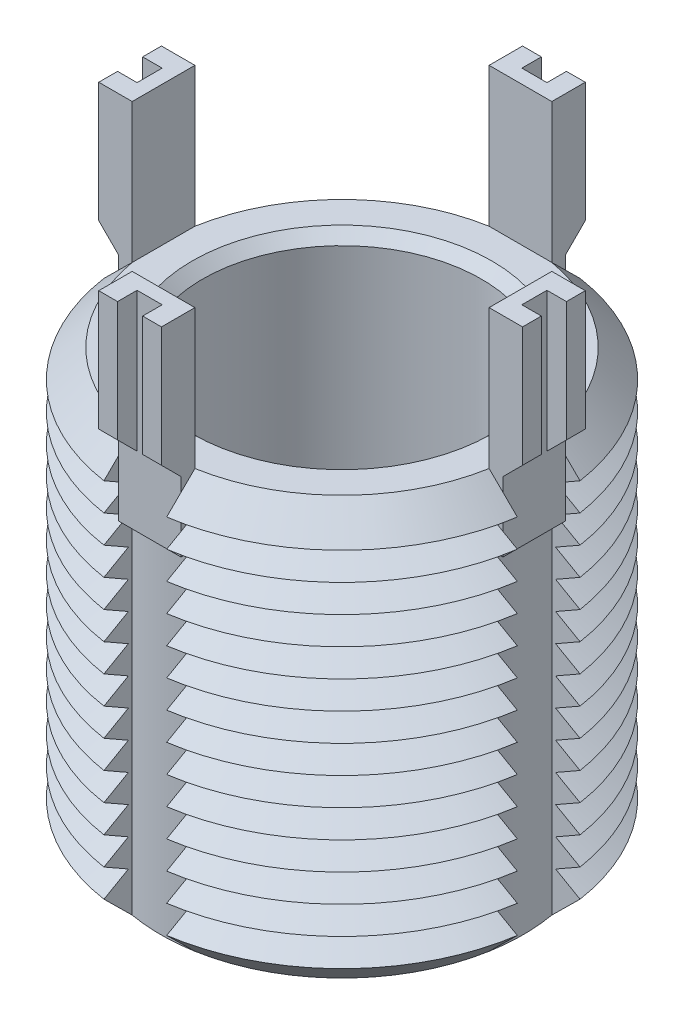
from build123d import *

# Parameters (mm, degrees)
SKETCH1_R               = 15
BOSS_EXTRUDE1_DEPTH     = 30
CHAMFER1_SIZE           = 2
LPATTERN1_COUNT         = 13
LPATTERN1_PITCH         = 2
CUT_EXTRUDE1_REACH      = 38.742
CIRPATTERN1_COUNT       = 4
BOSS_EXTRUDE3_DEPTH     = 2.25
CIRPATTERN2_COUNT       = 4
CUT_EXTRUDE3_DEPTH      = 46.412680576
CUT_EXTRUDE3_DEPTH_BACK = 46.412680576
SKETCH6_W               = 1.4
SKETCH6_H               = 1.8
SKETCH6_W_2             = 1.8
SKETCH6_H_2             = 1.4
SKETCH7_R               = 10
CUT_EXTRUDE4_DEPTH      = 30
CHAMFER2_SIZE           = 0.75


with BuildPart() as part:
    # Sketch1 → Boss-Extrude1 (new body)
    with BuildSketch(Plane(origin=(0, 0, 0), x_dir=(1, 0, 0), z_dir=(0, 1, 0))):
        with Locations(Location((0, 0, 0), (0, 0, 270))):
            Circle(SKETCH1_R)
    extrude(amount=-BOSS_EXTRUDE1_DEPTH)

    # Chamfer1
    chamfer1_edges = [part.edges().sort_by_distance(p)[0] for p in [
        (0, 0, -15),
        (0, -30, -15),
    ]]
    chamfer(chamfer1_edges, length=CHAMFER1_SIZE)

    # Sketch3 → Cut-Revolve1 (revolve, cut)
    with BuildSketch(Plane(origin=(0, 0, 0), x_dir=(0, 0, -1), z_dir=(1, 0, 0))):
        Polygon((-15, -2), (-13.267949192, -3), (-15, -4), align=None)
    cut_revolve1 = revolve(axis=Axis((0, 0.885892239, 0), (0, -1, 0)), mode=Mode.SUBTRACT)

    # LPattern1: Cut-Revolve1 ×13
    with Locations(*[(0, -i * LPATTERN1_PITCH, 0) for i in range(1, LPATTERN1_COUNT)]):
        add(cut_revolve1, mode=Mode.SUBTRACT)

    # Cut-Extrude1: up to this cone (the profile starts inside it)
    cut_extrude1_end = Plane(origin=(0, 0, 0), z_dir=(0, 1, 0)).offset(-42.999999) * Cone(1e-06, 125.242, 125.241999, align=(Align.CENTER, Align.CENTER, Align.MIN), mode=Mode.PRIVATE)
    # Sketch4 → Cut-Extrude1 (cut, up to the surface)
    with BuildSketch(Plane(origin=(0, 0, 0), x_dir=(1, 0, 0), z_dir=(0, 1, 0)), mode=Mode.PRIVATE) as cut_extrude1_sk1:
        with BuildLine():
            Line((-12.803808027, 2.25), (-14.83028995, 2.25))
            ThreePointArc((-14.83028995, 2.25), (-15, 0), (-14.83028995, -2.25))
            Line((-14.83028995, -2.25), (-12.803808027, -2.25))
            ThreePointArc((-12.803808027, -2.25), (-13, 0), (-12.803808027, 2.25))
        make_face()
    cut_extrude1_tool1 = extrude(cut_extrude1_sk1.sketch, amount=-CUT_EXTRUDE1_REACH, mode=Mode.PRIVATE) & cut_extrude1_end
    cut_extrude1 = cut_extrude1_tool1.solids().sort_by_distance((-13.938966, 0, 0))[0]
    add(cut_extrude1, mode=Mode.SUBTRACT)

    # CirPattern1: Cut-Extrude1 ×4 about axis
    cirpattern1_axis = Axis((0, 0, 0), (0, 1, 0))
    for i in range(1, CIRPATTERN1_COUNT):
        add(cut_extrude1.rotate(cirpattern1_axis, i * 360 / CIRPATTERN1_COUNT), mode=Mode.SUBTRACT)

    # Sketch5 → Boss-Extrude3 (add, symmetric)
    with BuildSketch(Plane(origin=(0, 0, 0), x_dir=(0, 0, -1), z_dir=(1, 0, 0))):
        Polygon((-12.803808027, 10), (-12.803808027, -5), (-13.803808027, -5), (-13.803808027, 0), (-15.203808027, 1.4), (-15.203808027, 10), align=None)
    boss_extrude3 = extrude(amount=BOSS_EXTRUDE3_DEPTH, both=True)

    # CirPattern2: Boss-Extrude3 ×4 about axis
    cirpattern2_axis = Axis((0, 0, 0), (0, 1, 0))
    for i in range(1, CIRPATTERN2_COUNT):
        add(boss_extrude3.rotate(cirpattern2_axis, i * 360 / CIRPATTERN2_COUNT))

    # Sketch6 → Cut-Extrude3 (cut, two sides: drawn at the far end of the back side and taken through both)
    with BuildSketch(Plane(origin=(0, 10, 0), x_dir=(1, 0, 0), z_dir=(0, 1, 0)).offset(-CUT_EXTRUDE3_DEPTH_BACK)):
        with Locations((-14.503808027, 0)):
            Rectangle(SKETCH6_W, SKETCH6_H)
        with Locations((0, 14.503808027)):
            Rectangle(SKETCH6_W_2, SKETCH6_H_2)
        with Locations((14.503808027, 0)):
            Rectangle(SKETCH6_W, SKETCH6_H)
        with Locations((0, -14.503808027)):
            Rectangle(SKETCH6_W_2, SKETCH6_H_2)
    extrude(amount=CUT_EXTRUDE3_DEPTH + CUT_EXTRUDE3_DEPTH_BACK, mode=Mode.SUBTRACT)

    # Sketch7 → Cut-Extrude4 (cut)
    with BuildSketch(Plane(origin=(0, 0, 0), x_dir=(1, 0, 0), z_dir=(0, 1, 0))):
        with Locations(Location((0, 0, 0), (0, 0, 270))):
            Circle(SKETCH7_R)
    extrude(amount=-CUT_EXTRUDE4_DEPTH, mode=Mode.SUBTRACT)

    # Chamfer2
    chamfer2_edges = [part.edges().sort_by_distance(p)[0] for p in [
        (0, 0, -10),
        (0, -30, -10),
    ]]
    chamfer(chamfer2_edges, length=CHAMFER2_SIZE)


solid = part.part
